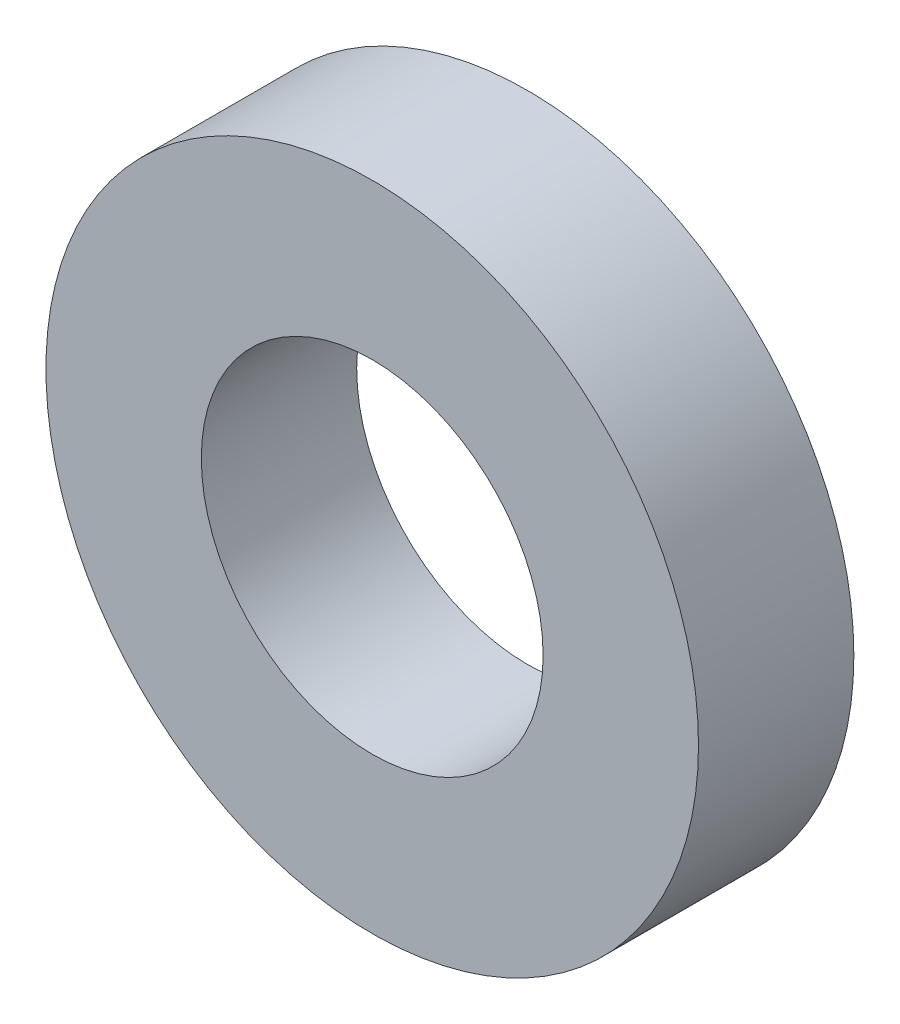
ISO-10303-21;
HEADER;
FILE_DESCRIPTION(('STEP AP214'),'2;1');
FILE_NAME('part.step','',(''),(''),'','','');
FILE_SCHEMA(('AUTOMOTIVE_DESIGN { 1 0 10303 214 1 1 1 1 }'));
ENDSEC;
DATA;
#1=APPLICATION_CONTEXT('core data for automotive mechanical design processes');
#2=APPLICATION_PROTOCOL_DEFINITION('international standard','automotive_design',2000,#1);
#3=PRODUCT_CONTEXT('',#1,'mechanical');
#4=PRODUCT('Part','Part','',(#3));
#5=PRODUCT_RELATED_PRODUCT_CATEGORY('part','',(#4));
#6=PRODUCT_DEFINITION_FORMATION('','',#4);
#7=PRODUCT_DEFINITION_CONTEXT('part definition',#1,'design');
#8=PRODUCT_DEFINITION('design','',#6,#7);
#9=PRODUCT_DEFINITION_SHAPE('','',#8);
#10=(LENGTH_UNIT() NAMED_UNIT(*) SI_UNIT(.MILLI.,.METRE.));
#11=(NAMED_UNIT(*) PLANE_ANGLE_UNIT() SI_UNIT($,.RADIAN.));
#12=(NAMED_UNIT(*) SI_UNIT($,.STERADIAN.) SOLID_ANGLE_UNIT());
#13=UNCERTAINTY_MEASURE_WITH_UNIT(LENGTH_MEASURE(1.E-05),#10,'distance_accuracy_value','');
#14=(GEOMETRIC_REPRESENTATION_CONTEXT(3) GLOBAL_UNCERTAINTY_ASSIGNED_CONTEXT((#13)) GLOBAL_UNIT_ASSIGNED_CONTEXT((#10,
#11,#12)) REPRESENTATION_CONTEXT('',''));
#15=CARTESIAN_POINT('',(0.,0.,0.));
#16=DIRECTION('',(0.,0.,1.));
#17=DIRECTION('',(1.,0.,0.));
#18=AXIS2_PLACEMENT_3D('',#15,#16,#17);
#19=CARTESIAN_POINT('',(0.,0.,-1.));
#20=DIRECTION('',(0.,0.,1.));
#21=DIRECTION('',(1.,0.,0.));
#22=AXIS2_PLACEMENT_3D('',#19,#20,#21);
#23=CYLINDRICAL_SURFACE('',#22,2.1);
#24=CARTESIAN_POINT('',(0.,0.,-1.));
#25=DIRECTION('',(0.,0.,1.));
#26=DIRECTION('',(1.,0.,0.));
#27=AXIS2_PLACEMENT_3D('',#24,#25,#26);
#28=CIRCLE('',#27,2.1);
#29=CARTESIAN_POINT('',(2.1,0.,-1.));
#30=VERTEX_POINT('',#29);
#31=EDGE_CURVE('E10',#30,#30,#28,.T.);
#32=ORIENTED_EDGE('',*,*,#31,.T.);
#33=EDGE_LOOP('',(#32));
#34=FACE_BOUND('',#33,.T.);
#35=CARTESIAN_POINT('',(0.,0.,0.));
#36=DIRECTION('',(0.,0.,1.));
#37=DIRECTION('',(1.,0.,0.));
#38=AXIS2_PLACEMENT_3D('',#35,#36,#37);
#39=CIRCLE('',#38,2.1);
#40=CARTESIAN_POINT('',(2.1,0.,0.));
#41=VERTEX_POINT('',#40);
#42=EDGE_CURVE('E37',#41,#41,#39,.T.);
#43=ORIENTED_EDGE('',*,*,#42,.F.);
#44=EDGE_LOOP('',(#43));
#45=FACE_BOUND('',#44,.T.);
#46=ADVANCED_FACE('F40',(#34,#45),#23,.T.);
#47=CARTESIAN_POINT('',(0.,0.,-1.));
#48=DIRECTION('',(0.,0.,1.));
#49=DIRECTION('',(1.,0.,0.));
#50=AXIS2_PLACEMENT_3D('',#47,#48,#49);
#51=PLANE('',#50);
#52=CARTESIAN_POINT('',(0.,0.,-1.));
#53=DIRECTION('',(0.,0.,1.));
#54=DIRECTION('',(1.,0.,0.));
#55=AXIS2_PLACEMENT_3D('',#52,#53,#54);
#56=CIRCLE('',#55,1.1);
#57=CARTESIAN_POINT('',(1.1,0.,-1.));
#58=VERTEX_POINT('',#57);
#59=EDGE_CURVE('E50',#58,#58,#56,.T.);
#60=ORIENTED_EDGE('',*,*,#59,.T.);
#61=EDGE_LOOP('',(#60));
#62=FACE_BOUND('',#61,.T.);
#63=ORIENTED_EDGE('',*,*,#31,.F.);
#64=EDGE_LOOP('',(#63));
#65=FACE_BOUND('',#64,.T.);
#66=ADVANCED_FACE('F54',(#62,#65),#51,.F.);
#67=CARTESIAN_POINT('',(0.,0.,0.));
#68=DIRECTION('',(0.,0.,1.));
#69=DIRECTION('',(1.,0.,0.));
#70=AXIS2_PLACEMENT_3D('',#67,#68,#69);
#71=PLANE('',#70);
#72=CARTESIAN_POINT('',(0.,0.,0.));
#73=DIRECTION('',(0.,0.,1.));
#74=DIRECTION('',(1.,0.,0.));
#75=AXIS2_PLACEMENT_3D('',#72,#73,#74);
#76=CIRCLE('',#75,1.1);
#77=CARTESIAN_POINT('',(1.1,0.,0.));
#78=VERTEX_POINT('',#77);
#79=EDGE_CURVE('E47',#78,#78,#76,.T.);
#80=ORIENTED_EDGE('',*,*,#79,.F.);
#81=EDGE_LOOP('',(#80));
#82=FACE_BOUND('',#81,.T.);
#83=ORIENTED_EDGE('',*,*,#42,.T.);
#84=EDGE_LOOP('',(#83));
#85=FACE_BOUND('',#84,.T.);
#86=ADVANCED_FACE('F62',(#82,#85),#71,.T.);
#87=CARTESIAN_POINT('',(0.,0.,-1.));
#88=DIRECTION('',(0.,0.,1.));
#89=DIRECTION('',(1.,0.,0.));
#90=AXIS2_PLACEMENT_3D('',#87,#88,#89);
#91=CYLINDRICAL_SURFACE('',#90,1.1);
#92=ORIENTED_EDGE('',*,*,#59,.F.);
#93=EDGE_LOOP('',(#92));
#94=FACE_BOUND('',#93,.T.);
#95=ORIENTED_EDGE('',*,*,#79,.T.);
#96=EDGE_LOOP('',(#95));
#97=FACE_BOUND('',#96,.T.);
#98=ADVANCED_FACE('F59',(#94,#97),#91,.F.);
#99=CLOSED_SHELL('',(#46,#66,#86,#98));
#100=MANIFOLD_SOLID_BREP('B2',#99);
#101=ADVANCED_BREP_SHAPE_REPRESENTATION('',(#18,#100),#14);
#102=SHAPE_DEFINITION_REPRESENTATION(#9,#101);
ENDSEC;
END-ISO-10303-21;
